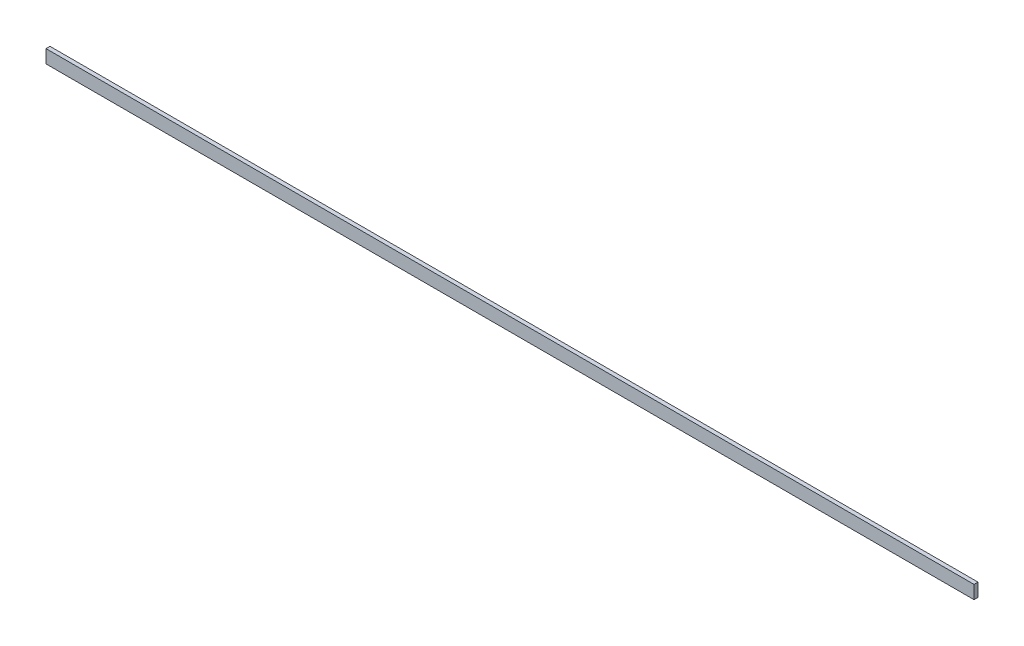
ISO-10303-21;
HEADER;
FILE_DESCRIPTION(('STEP AP214'),'2;1');
FILE_NAME('part.step','',(''),(''),'','','');
FILE_SCHEMA(('AUTOMOTIVE_DESIGN { 1 0 10303 214 1 1 1 1 }'));
ENDSEC;
DATA;
#1=APPLICATION_CONTEXT('core data for automotive mechanical design processes');
#2=APPLICATION_PROTOCOL_DEFINITION('international standard','automotive_design',2000,#1);
#3=PRODUCT_CONTEXT('',#1,'mechanical');
#4=PRODUCT('Part','Part','',(#3));
#5=PRODUCT_RELATED_PRODUCT_CATEGORY('part','',(#4));
#6=PRODUCT_DEFINITION_FORMATION('','',#4);
#7=PRODUCT_DEFINITION_CONTEXT('part definition',#1,'design');
#8=PRODUCT_DEFINITION('design','',#6,#7);
#9=PRODUCT_DEFINITION_SHAPE('','',#8);
#10=(LENGTH_UNIT() NAMED_UNIT(*) SI_UNIT(.MILLI.,.METRE.));
#11=(NAMED_UNIT(*) PLANE_ANGLE_UNIT() SI_UNIT($,.RADIAN.));
#12=(NAMED_UNIT(*) SI_UNIT($,.STERADIAN.) SOLID_ANGLE_UNIT());
#13=UNCERTAINTY_MEASURE_WITH_UNIT(LENGTH_MEASURE(1.E-05),#10,'distance_accuracy_value','');
#14=(GEOMETRIC_REPRESENTATION_CONTEXT(3) GLOBAL_UNCERTAINTY_ASSIGNED_CONTEXT((#13)) GLOBAL_UNIT_ASSIGNED_CONTEXT((#10,
#11,#12)) REPRESENTATION_CONTEXT('',''));
#15=CARTESIAN_POINT('',(0.,0.,0.));
#16=DIRECTION('',(0.,0.,1.));
#17=DIRECTION('',(1.,0.,0.));
#18=AXIS2_PLACEMENT_3D('',#15,#16,#17);
#19=CARTESIAN_POINT('',(350.,-5.,3.));
#20=DIRECTION('',(-1.,0.,0.));
#21=DIRECTION('',(0.,0.,1.));
#22=AXIS2_PLACEMENT_3D('',#19,#20,#21);
#23=PLANE('',#22);
#24=DIRECTION('',(0.,1.,0.));
#25=VECTOR('',#24,1.);
#26=CARTESIAN_POINT('',(350.,-5.,0.));
#27=LINE('',#26,#25);
#28=CARTESIAN_POINT('',(350.,-5.,0.));
#29=VERTEX_POINT('',#28);
#30=CARTESIAN_POINT('',(350.,5.,0.));
#31=VERTEX_POINT('',#30);
#32=EDGE_CURVE('E113',#29,#31,#27,.T.);
#33=ORIENTED_EDGE('',*,*,#32,.T.);
#34=DIRECTION('',(0.,0.,-1.));
#35=VECTOR('',#34,1.);
#36=CARTESIAN_POINT('',(350.,5.,3.));
#37=LINE('',#36,#35);
#38=CARTESIAN_POINT('',(350.,5.,3.));
#39=VERTEX_POINT('',#38);
#40=EDGE_CURVE('E11',#39,#31,#37,.T.);
#41=ORIENTED_EDGE('',*,*,#40,.F.);
#42=DIRECTION('',(0.,1.,0.));
#43=VECTOR('',#42,1.);
#44=CARTESIAN_POINT('',(350.,-5.,3.));
#45=LINE('',#44,#43);
#46=CARTESIAN_POINT('',(350.,-5.,3.));
#47=VERTEX_POINT('',#46);
#48=EDGE_CURVE('E96',#47,#39,#45,.T.);
#49=ORIENTED_EDGE('',*,*,#48,.F.);
#50=DIRECTION('',(0.,0.,-1.));
#51=VECTOR('',#50,1.);
#52=CARTESIAN_POINT('',(350.,-5.,3.));
#53=LINE('',#52,#51);
#54=EDGE_CURVE('E109',#47,#29,#53,.T.);
#55=ORIENTED_EDGE('',*,*,#54,.T.);
#56=EDGE_LOOP('',(#33,#41,#49,#55));
#57=FACE_BOUND('',#56,.T.);
#58=ADVANCED_FACE('F44',(#57),#23,.F.);
#59=CARTESIAN_POINT('',(-350.,5.,3.));
#60=DIRECTION('',(0.,-1.,0.));
#61=DIRECTION('',(0.,0.,-1.));
#62=AXIS2_PLACEMENT_3D('',#59,#60,#61);
#63=PLANE('',#62);
#64=DIRECTION('',(-1.,0.,0.));
#65=VECTOR('',#64,1.);
#66=CARTESIAN_POINT('',(-350.,5.,0.));
#67=LINE('',#66,#65);
#68=CARTESIAN_POINT('',(-350.,5.,0.));
#69=VERTEX_POINT('',#68);
#70=EDGE_CURVE('E101',#31,#69,#67,.T.);
#71=ORIENTED_EDGE('',*,*,#70,.T.);
#72=DIRECTION('',(0.,0.,-1.));
#73=VECTOR('',#72,1.);
#74=CARTESIAN_POINT('',(-350.,5.,3.));
#75=LINE('',#74,#73);
#76=CARTESIAN_POINT('',(-350.,5.,3.));
#77=VERTEX_POINT('',#76);
#78=EDGE_CURVE('E53',#77,#69,#75,.T.);
#79=ORIENTED_EDGE('',*,*,#78,.F.);
#80=DIRECTION('',(-1.,0.,0.));
#81=VECTOR('',#80,1.);
#82=CARTESIAN_POINT('',(-350.,5.,3.));
#83=LINE('',#82,#81);
#84=EDGE_CURVE('E91',#39,#77,#83,.T.);
#85=ORIENTED_EDGE('',*,*,#84,.F.);
#86=ORIENTED_EDGE('',*,*,#40,.T.);
#87=EDGE_LOOP('',(#71,#79,#85,#86));
#88=FACE_BOUND('',#87,.T.);
#89=ADVANCED_FACE('F100',(#88),#63,.F.);
#90=CARTESIAN_POINT('',(-350.,-5.,3.));
#91=DIRECTION('',(1.,0.,0.));
#92=DIRECTION('',(0.,0.,-1.));
#93=AXIS2_PLACEMENT_3D('',#90,#91,#92);
#94=PLANE('',#93);
#95=DIRECTION('',(0.,-1.,0.));
#96=VECTOR('',#95,1.);
#97=CARTESIAN_POINT('',(-350.,-5.,0.));
#98=LINE('',#97,#96);
#99=CARTESIAN_POINT('',(-350.,-5.,0.));
#100=VERTEX_POINT('',#99);
#101=EDGE_CURVE('E78',#69,#100,#98,.T.);
#102=ORIENTED_EDGE('',*,*,#101,.T.);
#103=DIRECTION('',(0.,0.,-1.));
#104=VECTOR('',#103,1.);
#105=CARTESIAN_POINT('',(-350.,-5.,3.));
#106=LINE('',#105,#104);
#107=CARTESIAN_POINT('',(-350.,-5.,3.));
#108=VERTEX_POINT('',#107);
#109=EDGE_CURVE('E103',#108,#100,#106,.T.);
#110=ORIENTED_EDGE('',*,*,#109,.F.);
#111=DIRECTION('',(0.,-1.,0.));
#112=VECTOR('',#111,1.);
#113=CARTESIAN_POINT('',(-350.,-5.,3.));
#114=LINE('',#113,#112);
#115=EDGE_CURVE('E94',#77,#108,#114,.T.);
#116=ORIENTED_EDGE('',*,*,#115,.F.);
#117=ORIENTED_EDGE('',*,*,#78,.T.);
#118=EDGE_LOOP('',(#102,#110,#116,#117));
#119=FACE_BOUND('',#118,.T.);
#120=ADVANCED_FACE('F104',(#119),#94,.F.);
#121=CARTESIAN_POINT('',(-350.,-5.,3.));
#122=DIRECTION('',(0.,1.,0.));
#123=DIRECTION('',(0.,0.,1.));
#124=AXIS2_PLACEMENT_3D('',#121,#122,#123);
#125=PLANE('',#124);
#126=DIRECTION('',(1.,0.,0.));
#127=VECTOR('',#126,1.);
#128=CARTESIAN_POINT('',(-350.,-5.,0.));
#129=LINE('',#128,#127);
#130=EDGE_CURVE('E84',#100,#29,#129,.T.);
#131=ORIENTED_EDGE('',*,*,#130,.T.);
#132=ORIENTED_EDGE('',*,*,#54,.F.);
#133=DIRECTION('',(1.,0.,0.));
#134=VECTOR('',#133,1.);
#135=CARTESIAN_POINT('',(-350.,-5.,3.));
#136=LINE('',#135,#134);
#137=EDGE_CURVE('E61',#108,#47,#136,.T.);
#138=ORIENTED_EDGE('',*,*,#137,.F.);
#139=ORIENTED_EDGE('',*,*,#109,.T.);
#140=EDGE_LOOP('',(#131,#132,#138,#139));
#141=FACE_BOUND('',#140,.T.);
#142=ADVANCED_FACE('F127',(#141),#125,.F.);
#143=CARTESIAN_POINT('',(0.,0.,3.));
#144=DIRECTION('',(0.,0.,-1.));
#145=DIRECTION('',(-1.,0.,0.));
#146=AXIS2_PLACEMENT_3D('',#143,#144,#145);
#147=PLANE('',#146);
#148=ORIENTED_EDGE('',*,*,#48,.T.);
#149=ORIENTED_EDGE('',*,*,#84,.T.);
#150=ORIENTED_EDGE('',*,*,#115,.T.);
#151=ORIENTED_EDGE('',*,*,#137,.T.);
#152=EDGE_LOOP('',(#148,#149,#150,#151));
#153=FACE_BOUND('',#152,.T.);
#154=ADVANCED_FACE('F92',(#153),#147,.F.);
#155=CARTESIAN_POINT('',(0.,0.,0.));
#156=DIRECTION('',(0.,0.,-1.));
#157=DIRECTION('',(-1.,0.,0.));
#158=AXIS2_PLACEMENT_3D('',#155,#156,#157);
#159=PLANE('',#158);
#160=ORIENTED_EDGE('',*,*,#32,.F.);
#161=ORIENTED_EDGE('',*,*,#130,.F.);
#162=ORIENTED_EDGE('',*,*,#101,.F.);
#163=ORIENTED_EDGE('',*,*,#70,.F.);
#164=EDGE_LOOP('',(#160,#161,#162,#163));
#165=FACE_BOUND('',#164,.T.);
#166=ADVANCED_FACE('F130',(#165),#159,.T.);
#167=CLOSED_SHELL('',(#58,#89,#120,#142,#154,#166));
#168=MANIFOLD_SOLID_BREP('B2',#167);
#169=ADVANCED_BREP_SHAPE_REPRESENTATION('',(#18,#168),#14);
#170=SHAPE_DEFINITION_REPRESENTATION(#9,#169);
ENDSEC;
END-ISO-10303-21;
